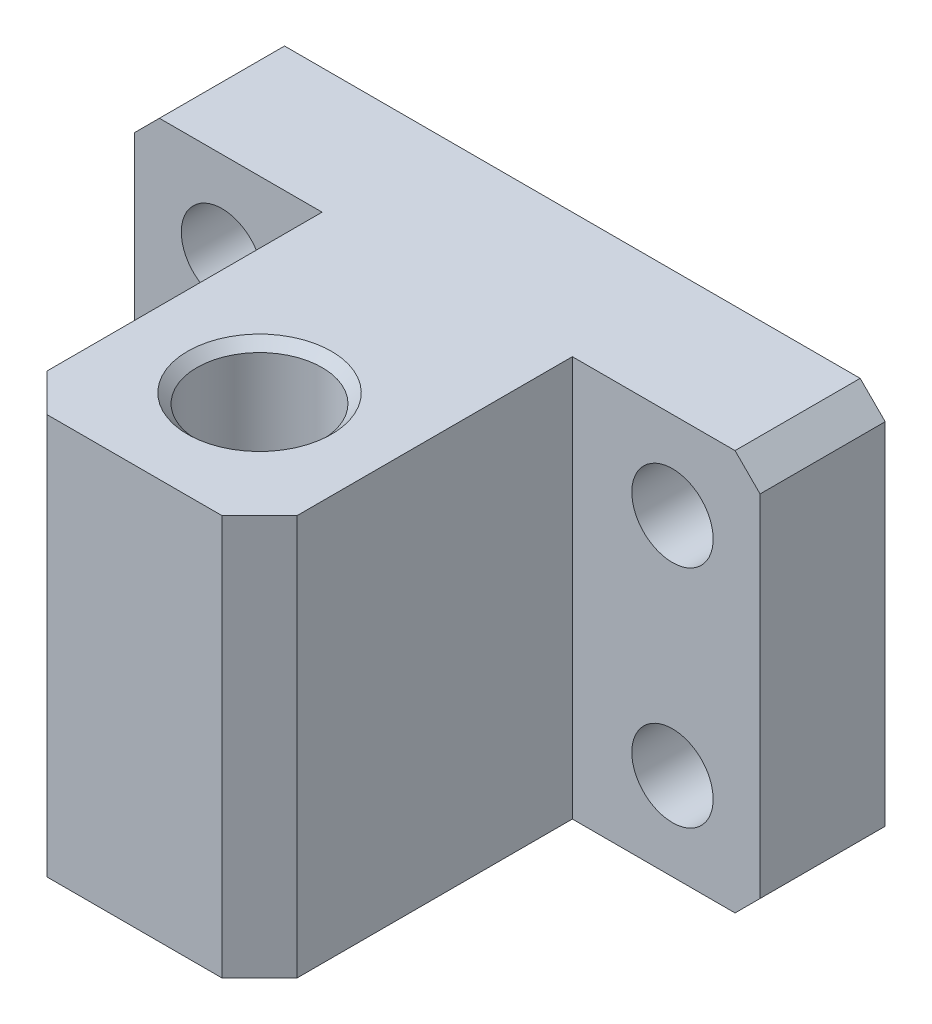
ISO-10303-21;
HEADER;
FILE_DESCRIPTION(('STEP AP214'),'2;1');
FILE_NAME('part.step','',(''),(''),'','','');
FILE_SCHEMA(('AUTOMOTIVE_DESIGN { 1 0 10303 214 1 1 1 1 }'));
ENDSEC;
DATA;
#1=APPLICATION_CONTEXT('core data for automotive mechanical design processes');
#2=APPLICATION_PROTOCOL_DEFINITION('international standard','automotive_design',2000,#1);
#3=PRODUCT_CONTEXT('',#1,'mechanical');
#4=PRODUCT('Part','Part','',(#3));
#5=PRODUCT_RELATED_PRODUCT_CATEGORY('part','',(#4));
#6=PRODUCT_DEFINITION_FORMATION('','',#4);
#7=PRODUCT_DEFINITION_CONTEXT('part definition',#1,'design');
#8=PRODUCT_DEFINITION('design','',#6,#7);
#9=PRODUCT_DEFINITION_SHAPE('','',#8);
#10=(LENGTH_UNIT() NAMED_UNIT(*) SI_UNIT(.MILLI.,.METRE.));
#11=(NAMED_UNIT(*) PLANE_ANGLE_UNIT() SI_UNIT($,.RADIAN.));
#12=(NAMED_UNIT(*) SI_UNIT($,.STERADIAN.) SOLID_ANGLE_UNIT());
#13=UNCERTAINTY_MEASURE_WITH_UNIT(LENGTH_MEASURE(1.E-05),#10,'distance_accuracy_value','');
#14=(GEOMETRIC_REPRESENTATION_CONTEXT(3) GLOBAL_UNCERTAINTY_ASSIGNED_CONTEXT((#13)) GLOBAL_UNIT_ASSIGNED_CONTEXT((#10,
#11,#12)) REPRESENTATION_CONTEXT('',''));
#15=CARTESIAN_POINT('',(0.,0.,0.));
#16=DIRECTION('',(0.,0.,1.));
#17=DIRECTION('',(1.,0.,0.));
#18=AXIS2_PLACEMENT_3D('',#15,#16,#17);
#19=CARTESIAN_POINT('',(-7.,25.,10.));
#20=DIRECTION('',(-1.,0.,0.));
#21=DIRECTION('',(0.,0.,-1.));
#22=AXIS2_PLACEMENT_3D('',#19,#20,#21);
#23=PLANE('',#22);
#24=DIRECTION('',(0.,-1.,0.));
#25=VECTOR('',#24,1.);
#26=CARTESIAN_POINT('',(-7.,25.,0.));
#27=LINE('',#26,#25);
#28=CARTESIAN_POINT('',(-7.,23.,0.));
#29=VERTEX_POINT('',#28);
#30=CARTESIAN_POINT('',(-7.,-5.,0.));
#31=VERTEX_POINT('',#30);
#32=EDGE_CURVE('E152',#29,#31,#27,.T.);
#33=ORIENTED_EDGE('',*,*,#32,.T.);
#34=DIRECTION('',(0.,0.,1.));
#35=VECTOR('',#34,1.);
#36=CARTESIAN_POINT('',(-7.,-5.,10.));
#37=LINE('',#36,#35);
#38=CARTESIAN_POINT('',(-7.,-5.,10.));
#39=VERTEX_POINT('',#38);
#40=EDGE_CURVE('E209',#31,#39,#37,.T.);
#41=ORIENTED_EDGE('',*,*,#40,.T.);
#42=DIRECTION('',(0.,-1.,0.));
#43=VECTOR('',#42,1.);
#44=CARTESIAN_POINT('',(-7.,25.,10.));
#45=LINE('',#44,#43);
#46=CARTESIAN_POINT('',(-7.,23.,10.));
#47=VERTEX_POINT('',#46);
#48=EDGE_CURVE('E168',#47,#39,#45,.T.);
#49=ORIENTED_EDGE('',*,*,#48,.F.);
#50=DIRECTION('',(0.,0.,-1.));
#51=VECTOR('',#50,1.);
#52=CARTESIAN_POINT('',(-7.,23.,10.));
#53=LINE('',#52,#51);
#54=EDGE_CURVE('E206',#47,#29,#53,.T.);
#55=ORIENTED_EDGE('',*,*,#54,.T.);
#56=EDGE_LOOP('',(#33,#41,#49,#55));
#57=FACE_BOUND('',#56,.T.);
#58=ADVANCED_FACE('F14',(#57),#23,.T.);
#59=CARTESIAN_POINT('',(8.,25.,10.));
#60=DIRECTION('',(0.,0.,1.));
#61=DIRECTION('',(-1.,0.,0.));
#62=AXIS2_PLACEMENT_3D('',#59,#60,#61);
#63=PLANE('',#62);
#64=CARTESIAN_POINT('',(0.,18.,10.));
#65=DIRECTION('',(0.,0.,1.));
#66=DIRECTION('',(0.,-1.,0.));
#67=AXIS2_PLACEMENT_3D('',#64,#65,#66);
#68=CIRCLE('',#67,3.25);
#69=CARTESIAN_POINT('',(0.,14.75,10.));
#70=VERTEX_POINT('',#69);
#71=EDGE_CURVE('E335',#70,#70,#68,.T.);
#72=ORIENTED_EDGE('',*,*,#71,.F.);
#73=EDGE_LOOP('',(#72));
#74=FACE_BOUND('',#73,.T.);
#75=CARTESIAN_POINT('',(0.,0.,10.));
#76=DIRECTION('',(0.,0.,1.));
#77=DIRECTION('',(0.,-1.,0.));
#78=AXIS2_PLACEMENT_3D('',#75,#76,#77);
#79=CIRCLE('',#78,3.25);
#80=CARTESIAN_POINT('',(0.,-3.25,10.));
#81=VERTEX_POINT('',#80);
#82=EDGE_CURVE('E317',#81,#81,#79,.T.);
#83=ORIENTED_EDGE('',*,*,#82,.F.);
#84=EDGE_LOOP('',(#83));
#85=FACE_BOUND('',#84,.T.);
#86=ORIENTED_EDGE('',*,*,#48,.T.);
#87=DIRECTION('',(0.707106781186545,-0.707106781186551,0.));
#88=VECTOR('',#87,1.);
#89=CARTESIAN_POINT('',(-14.5,2.50000000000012,10.));
#90=LINE('',#89,#88);
#91=CARTESIAN_POINT('',(-5.,-7.,10.));
#92=VERTEX_POINT('',#91);
#93=EDGE_CURVE('E213',#39,#92,#90,.T.);
#94=ORIENTED_EDGE('',*,*,#93,.T.);
#95=DIRECTION('',(-1.,0.,0.));
#96=VECTOR('',#95,1.);
#97=CARTESIAN_POINT('',(8.,-7.,10.));
#98=LINE('',#97,#96);
#99=CARTESIAN_POINT('',(8.,-7.,10.));
#100=VERTEX_POINT('',#99);
#101=EDGE_CURVE('E165',#100,#92,#98,.T.);
#102=ORIENTED_EDGE('',*,*,#101,.F.);
#103=DIRECTION('',(0.,-1.,0.));
#104=VECTOR('',#103,1.);
#105=CARTESIAN_POINT('',(8.,25.,10.));
#106=LINE('',#105,#104);
#107=CARTESIAN_POINT('',(8.,25.,10.));
#108=VERTEX_POINT('',#107);
#109=EDGE_CURVE('E137',#108,#100,#106,.T.);
#110=ORIENTED_EDGE('',*,*,#109,.F.);
#111=DIRECTION('',(-1.,0.,0.));
#112=VECTOR('',#111,1.);
#113=CARTESIAN_POINT('',(8.,25.,10.));
#114=LINE('',#113,#112);
#115=CARTESIAN_POINT('',(-5.,25.,10.));
#116=VERTEX_POINT('',#115);
#117=EDGE_CURVE('E149',#108,#116,#114,.T.);
#118=ORIENTED_EDGE('',*,*,#117,.T.);
#119=DIRECTION('',(0.707106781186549,0.707106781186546,0.));
#120=VECTOR('',#119,1.);
#121=CARTESIAN_POINT('',(1.50000000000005,31.5,10.));
#122=LINE('',#121,#120);
#123=EDGE_CURVE('E211',#116,#47,#122,.F.);
#124=ORIENTED_EDGE('',*,*,#123,.T.);
#125=EDGE_LOOP('',(#86,#94,#102,#110,#118,#124));
#126=FACE_BOUND('',#125,.T.);
#127=ADVANCED_FACE('F250',(#74,#85,#126),#63,.T.);
#128=CARTESIAN_POINT('',(8.,25.,35.));
#129=DIRECTION('',(-1.,0.,0.));
#130=DIRECTION('',(0.,0.,-1.));
#131=AXIS2_PLACEMENT_3D('',#128,#129,#130);
#132=PLANE('',#131);
#133=DIRECTION('',(0.,0.,-1.));
#134=VECTOR('',#133,1.);
#135=CARTESIAN_POINT('',(8.,-7.,35.));
#136=LINE('',#135,#134);
#137=CARTESIAN_POINT('',(8.,-7.,32.));
#138=VERTEX_POINT('',#137);
#139=EDGE_CURVE('E163',#138,#100,#136,.T.);
#140=ORIENTED_EDGE('',*,*,#139,.F.);
#141=DIRECTION('',(0.,1.,0.));
#142=VECTOR('',#141,1.);
#143=CARTESIAN_POINT('',(8.,25.,32.));
#144=LINE('',#143,#142);
#145=CARTESIAN_POINT('',(8.,25.,32.));
#146=VERTEX_POINT('',#145);
#147=EDGE_CURVE('E38',#138,#146,#144,.T.);
#148=ORIENTED_EDGE('',*,*,#147,.T.);
#149=DIRECTION('',(0.,0.,-1.));
#150=VECTOR('',#149,1.);
#151=CARTESIAN_POINT('',(8.,25.,35.));
#152=LINE('',#151,#150);
#153=EDGE_CURVE('E144',#146,#108,#152,.T.);
#154=ORIENTED_EDGE('',*,*,#153,.T.);
#155=ORIENTED_EDGE('',*,*,#109,.T.);
#156=EDGE_LOOP('',(#140,#148,#154,#155));
#157=FACE_BOUND('',#156,.T.);
#158=ADVANCED_FACE('F256',(#157),#132,.T.);
#159=CARTESIAN_POINT('',(28.,25.,35.));
#160=DIRECTION('',(0.,0.,1.));
#161=DIRECTION('',(0.,-1.,0.));
#162=AXIS2_PLACEMENT_3D('',#159,#160,#161);
#163=PLANE('',#162);
#164=DIRECTION('',(-1.,0.,0.));
#165=VECTOR('',#164,1.);
#166=CARTESIAN_POINT('',(28.,25.,35.));
#167=LINE('',#166,#165);
#168=CARTESIAN_POINT('',(25.,25.,35.));
#169=VERTEX_POINT('',#168);
#170=CARTESIAN_POINT('',(11.,25.,35.));
#171=VERTEX_POINT('',#170);
#172=EDGE_CURVE('E141',#169,#171,#167,.T.);
#173=ORIENTED_EDGE('',*,*,#172,.T.);
#174=DIRECTION('',(0.,-1.,0.));
#175=VECTOR('',#174,1.);
#176=CARTESIAN_POINT('',(11.,25.,35.));
#177=LINE('',#176,#175);
#178=CARTESIAN_POINT('',(11.,-7.,35.));
#179=VERTEX_POINT('',#178);
#180=EDGE_CURVE('E217',#171,#179,#177,.T.);
#181=ORIENTED_EDGE('',*,*,#180,.T.);
#182=DIRECTION('',(-1.,0.,0.));
#183=VECTOR('',#182,1.);
#184=CARTESIAN_POINT('',(28.,-7.,35.));
#185=LINE('',#184,#183);
#186=CARTESIAN_POINT('',(25.,-7.,35.));
#187=VERTEX_POINT('',#186);
#188=EDGE_CURVE('E160',#187,#179,#185,.T.);
#189=ORIENTED_EDGE('',*,*,#188,.F.);
#190=DIRECTION('',(0.,1.,0.));
#191=VECTOR('',#190,1.);
#192=CARTESIAN_POINT('',(25.,25.,35.));
#193=LINE('',#192,#191);
#194=EDGE_CURVE('E215',#187,#169,#193,.T.);
#195=ORIENTED_EDGE('',*,*,#194,.T.);
#196=EDGE_LOOP('',(#173,#181,#189,#195));
#197=FACE_BOUND('',#196,.T.);
#198=ADVANCED_FACE('F288',(#197),#163,.T.);
#199=CARTESIAN_POINT('',(28.,25.,10.));
#200=DIRECTION('',(1.,0.,0.));
#201=DIRECTION('',(0.,0.,1.));
#202=AXIS2_PLACEMENT_3D('',#199,#200,#201);
#203=PLANE('',#202);
#204=DIRECTION('',(0.,0.,1.));
#205=VECTOR('',#204,1.);
#206=CARTESIAN_POINT('',(28.,25.,10.));
#207=LINE('',#206,#205);
#208=CARTESIAN_POINT('',(28.,25.,10.));
#209=VERTEX_POINT('',#208);
#210=CARTESIAN_POINT('',(28.,25.,32.));
#211=VERTEX_POINT('',#210);
#212=EDGE_CURVE('E128',#209,#211,#207,.T.);
#213=ORIENTED_EDGE('',*,*,#212,.T.);
#214=DIRECTION('',(0.,-1.,0.));
#215=VECTOR('',#214,1.);
#216=CARTESIAN_POINT('',(28.,25.,32.));
#217=LINE('',#216,#215);
#218=CARTESIAN_POINT('',(28.,-7.,32.));
#219=VERTEX_POINT('',#218);
#220=EDGE_CURVE('E228',#211,#219,#217,.T.);
#221=ORIENTED_EDGE('',*,*,#220,.T.);
#222=DIRECTION('',(0.,0.,1.));
#223=VECTOR('',#222,1.);
#224=CARTESIAN_POINT('',(28.,-7.,10.));
#225=LINE('',#224,#223);
#226=CARTESIAN_POINT('',(28.,-7.,10.));
#227=VERTEX_POINT('',#226);
#228=EDGE_CURVE('E136',#227,#219,#225,.T.);
#229=ORIENTED_EDGE('',*,*,#228,.F.);
#230=DIRECTION('',(0.,-1.,0.));
#231=VECTOR('',#230,1.);
#232=CARTESIAN_POINT('',(28.,25.,10.));
#233=LINE('',#232,#231);
#234=EDGE_CURVE('E123',#209,#227,#233,.T.);
#235=ORIENTED_EDGE('',*,*,#234,.F.);
#236=EDGE_LOOP('',(#213,#221,#229,#235));
#237=FACE_BOUND('',#236,.T.);
#238=ADVANCED_FACE('F132',(#237),#203,.T.);
#239=CARTESIAN_POINT('',(43.,25.,10.));
#240=DIRECTION('',(0.,0.,1.));
#241=DIRECTION('',(-1.,0.,0.));
#242=AXIS2_PLACEMENT_3D('',#239,#240,#241);
#243=PLANE('',#242);
#244=CARTESIAN_POINT('',(36.,18.,10.));
#245=DIRECTION('',(0.,0.,1.));
#246=DIRECTION('',(0.,-1.,0.));
#247=AXIS2_PLACEMENT_3D('',#244,#245,#246);
#248=CIRCLE('',#247,3.25);
#249=CARTESIAN_POINT('',(36.,14.75,10.));
#250=VERTEX_POINT('',#249);
#251=EDGE_CURVE('E329',#250,#250,#248,.T.);
#252=ORIENTED_EDGE('',*,*,#251,.F.);
#253=EDGE_LOOP('',(#252));
#254=FACE_BOUND('',#253,.T.);
#255=CARTESIAN_POINT('',(36.,0.,10.));
#256=DIRECTION('',(0.,0.,1.));
#257=DIRECTION('',(0.,-1.,0.));
#258=AXIS2_PLACEMENT_3D('',#255,#256,#257);
#259=CIRCLE('',#258,3.25);
#260=CARTESIAN_POINT('',(36.,-3.25,10.));
#261=VERTEX_POINT('',#260);
#262=EDGE_CURVE('E323',#261,#261,#259,.T.);
#263=ORIENTED_EDGE('',*,*,#262,.F.);
#264=EDGE_LOOP('',(#263));
#265=FACE_BOUND('',#264,.T.);
#266=DIRECTION('',(-1.,0.,0.));
#267=VECTOR('',#266,1.);
#268=CARTESIAN_POINT('',(43.,-7.,10.));
#269=LINE('',#268,#267);
#270=CARTESIAN_POINT('',(41.,-7.,10.));
#271=VERTEX_POINT('',#270);
#272=EDGE_CURVE('E156',#271,#227,#269,.T.);
#273=ORIENTED_EDGE('',*,*,#272,.F.);
#274=DIRECTION('',(0.707106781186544,0.707106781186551,0.));
#275=VECTOR('',#274,1.);
#276=CARTESIAN_POINT('',(58.,10.0000000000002,10.));
#277=LINE('',#276,#275);
#278=CARTESIAN_POINT('',(43.,-5.,10.));
#279=VERTEX_POINT('',#278);
#280=EDGE_CURVE('E187',#271,#279,#277,.T.);
#281=ORIENTED_EDGE('',*,*,#280,.T.);
#282=DIRECTION('',(0.,-1.,0.));
#283=VECTOR('',#282,1.);
#284=CARTESIAN_POINT('',(43.,25.,10.));
#285=LINE('',#284,#283);
#286=CARTESIAN_POINT('',(43.,23.,10.));
#287=VERTEX_POINT('',#286);
#288=EDGE_CURVE('E138',#287,#279,#285,.T.);
#289=ORIENTED_EDGE('',*,*,#288,.F.);
#290=DIRECTION('',(0.70710678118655,-0.707106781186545,0.));
#291=VECTOR('',#290,1.);
#292=CARTESIAN_POINT('',(42.,24.,10.));
#293=LINE('',#292,#291);
#294=CARTESIAN_POINT('',(41.,25.,10.));
#295=VERTEX_POINT('',#294);
#296=EDGE_CURVE('E126',#287,#295,#293,.F.);
#297=ORIENTED_EDGE('',*,*,#296,.T.);
#298=DIRECTION('',(-1.,0.,0.));
#299=VECTOR('',#298,1.);
#300=CARTESIAN_POINT('',(43.,25.,10.));
#301=LINE('',#300,#299);
#302=EDGE_CURVE('E119',#295,#209,#301,.T.);
#303=ORIENTED_EDGE('',*,*,#302,.T.);
#304=ORIENTED_EDGE('',*,*,#234,.T.);
#305=EDGE_LOOP('',(#273,#281,#289,#297,#303,#304));
#306=FACE_BOUND('',#305,.T.);
#307=ADVANCED_FACE('F122',(#254,#265,#306),#243,.T.);
#308=CARTESIAN_POINT('',(43.,25.,0.));
#309=DIRECTION('',(1.,0.,0.));
#310=DIRECTION('',(0.,0.,1.));
#311=AXIS2_PLACEMENT_3D('',#308,#309,#310);
#312=PLANE('',#311);
#313=ORIENTED_EDGE('',*,*,#288,.T.);
#314=DIRECTION('',(0.,0.,-1.));
#315=VECTOR('',#314,1.);
#316=CARTESIAN_POINT('',(43.,-5.,0.));
#317=LINE('',#316,#315);
#318=CARTESIAN_POINT('',(43.,-5.,0.));
#319=VERTEX_POINT('',#318);
#320=EDGE_CURVE('E192',#279,#319,#317,.T.);
#321=ORIENTED_EDGE('',*,*,#320,.T.);
#322=DIRECTION('',(0.,-1.,0.));
#323=VECTOR('',#322,1.);
#324=CARTESIAN_POINT('',(43.,25.,0.));
#325=LINE('',#324,#323);
#326=CARTESIAN_POINT('',(43.,23.,0.));
#327=VERTEX_POINT('',#326);
#328=EDGE_CURVE('E176',#327,#319,#325,.T.);
#329=ORIENTED_EDGE('',*,*,#328,.F.);
#330=DIRECTION('',(0.,0.,1.));
#331=VECTOR('',#330,1.);
#332=CARTESIAN_POINT('',(43.,23.,0.));
#333=LINE('',#332,#331);
#334=EDGE_CURVE('E189',#327,#287,#333,.T.);
#335=ORIENTED_EDGE('',*,*,#334,.T.);
#336=EDGE_LOOP('',(#313,#321,#329,#335));
#337=FACE_BOUND('',#336,.T.);
#338=ADVANCED_FACE('F296',(#337),#312,.T.);
#339=CARTESIAN_POINT('',(-7.,25.,0.));
#340=DIRECTION('',(0.,0.,-1.));
#341=DIRECTION('',(0.,1.,0.));
#342=AXIS2_PLACEMENT_3D('',#339,#340,#341);
#343=PLANE('',#342);
#344=CARTESIAN_POINT('',(0.,18.,0.));
#345=DIRECTION('',(0.,0.,-1.));
#346=DIRECTION('',(0.,1.,0.));
#347=AXIS2_PLACEMENT_3D('',#344,#345,#346);
#348=CIRCLE('',#347,3.25);
#349=CARTESIAN_POINT('',(0.,21.25,0.));
#350=VERTEX_POINT('',#349);
#351=EDGE_CURVE('E332',#350,#350,#348,.T.);
#352=ORIENTED_EDGE('',*,*,#351,.F.);
#353=EDGE_LOOP('',(#352));
#354=FACE_BOUND('',#353,.T.);
#355=CARTESIAN_POINT('',(36.,18.,0.));
#356=DIRECTION('',(0.,0.,-1.));
#357=DIRECTION('',(0.,1.,0.));
#358=AXIS2_PLACEMENT_3D('',#355,#356,#357);
#359=CIRCLE('',#358,3.25);
#360=CARTESIAN_POINT('',(36.,21.25,0.));
#361=VERTEX_POINT('',#360);
#362=EDGE_CURVE('E326',#361,#361,#359,.T.);
#363=ORIENTED_EDGE('',*,*,#362,.F.);
#364=EDGE_LOOP('',(#363));
#365=FACE_BOUND('',#364,.T.);
#366=CARTESIAN_POINT('',(36.,0.,0.));
#367=DIRECTION('',(0.,0.,-1.));
#368=DIRECTION('',(0.,1.,0.));
#369=AXIS2_PLACEMENT_3D('',#366,#367,#368);
#370=CIRCLE('',#369,3.25);
#371=CARTESIAN_POINT('',(36.,3.25,0.));
#372=VERTEX_POINT('',#371);
#373=EDGE_CURVE('E320',#372,#372,#370,.T.);
#374=ORIENTED_EDGE('',*,*,#373,.F.);
#375=EDGE_LOOP('',(#374));
#376=FACE_BOUND('',#375,.T.);
#377=CARTESIAN_POINT('',(0.,0.,0.));
#378=DIRECTION('',(0.,0.,-1.));
#379=DIRECTION('',(0.,1.,0.));
#380=AXIS2_PLACEMENT_3D('',#377,#378,#379);
#381=CIRCLE('',#380,3.25);
#382=CARTESIAN_POINT('',(0.,3.25,0.));
#383=VERTEX_POINT('',#382);
#384=EDGE_CURVE('E157',#383,#383,#381,.T.);
#385=ORIENTED_EDGE('',*,*,#384,.F.);
#386=EDGE_LOOP('',(#385));
#387=FACE_BOUND('',#386,.T.);
#388=ORIENTED_EDGE('',*,*,#328,.T.);
#389=DIRECTION('',(-0.707106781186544,-0.707106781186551,0.));
#390=VECTOR('',#389,1.);
#391=CARTESIAN_POINT('',(33.,-14.9999999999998,0.));
#392=LINE('',#391,#390);
#393=CARTESIAN_POINT('',(41.,-7.,0.));
#394=VERTEX_POINT('',#393);
#395=EDGE_CURVE('E200',#319,#394,#392,.T.);
#396=ORIENTED_EDGE('',*,*,#395,.T.);
#397=DIRECTION('',(1.,0.,0.));
#398=VECTOR('',#397,1.);
#399=CARTESIAN_POINT('',(-7.,-7.,0.));
#400=LINE('',#399,#398);
#401=CARTESIAN_POINT('',(-5.,-7.,0.));
#402=VERTEX_POINT('',#401);
#403=EDGE_CURVE('E153',#402,#394,#400,.T.);
#404=ORIENTED_EDGE('',*,*,#403,.F.);
#405=DIRECTION('',(-0.707106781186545,0.707106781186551,0.));
#406=VECTOR('',#405,1.);
#407=CARTESIAN_POINT('',(-22.,10.0000000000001,0.));
#408=LINE('',#407,#406);
#409=EDGE_CURVE('E196',#402,#31,#408,.T.);
#410=ORIENTED_EDGE('',*,*,#409,.T.);
#411=ORIENTED_EDGE('',*,*,#32,.F.);
#412=DIRECTION('',(-0.707106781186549,-0.707106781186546,0.));
#413=VECTOR('',#412,1.);
#414=CARTESIAN_POINT('',(-6.,24.,0.));
#415=LINE('',#414,#413);
#416=CARTESIAN_POINT('',(-5.,25.,0.));
#417=VERTEX_POINT('',#416);
#418=EDGE_CURVE('E194',#29,#417,#415,.F.);
#419=ORIENTED_EDGE('',*,*,#418,.T.);
#420=DIRECTION('',(1.,0.,0.));
#421=VECTOR('',#420,1.);
#422=CARTESIAN_POINT('',(-7.,25.,0.));
#423=LINE('',#422,#421);
#424=CARTESIAN_POINT('',(41.,25.,0.));
#425=VERTEX_POINT('',#424);
#426=EDGE_CURVE('E129',#417,#425,#423,.T.);
#427=ORIENTED_EDGE('',*,*,#426,.T.);
#428=DIRECTION('',(-0.70710678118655,0.707106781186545,0.));
#429=VECTOR('',#428,1.);
#430=CARTESIAN_POINT('',(17.,49.,0.));
#431=LINE('',#430,#429);
#432=EDGE_CURVE('E198',#425,#327,#431,.F.);
#433=ORIENTED_EDGE('',*,*,#432,.T.);
#434=EDGE_LOOP('',(#388,#396,#404,#410,#411,#419,#427,#433));
#435=FACE_BOUND('',#434,.T.);
#436=ADVANCED_FACE('F261',(#354,#365,#376,#387,#435),#343,.T.);
#437=CARTESIAN_POINT('',(-7.,25.,10.));
#438=DIRECTION('',(0.,1.,0.));
#439=DIRECTION('',(-1.,0.,0.));
#440=AXIS2_PLACEMENT_3D('',#437,#438,#439);
#441=PLANE('',#440);
#442=CARTESIAN_POINT('',(18.,25.,25.));
#443=DIRECTION('',(0.,1.,0.));
#444=DIRECTION('',(-1.,0.,0.));
#445=AXIS2_PLACEMENT_3D('',#442,#443,#444);
#446=CIRCLE('',#445,5.75);
#447=CARTESIAN_POINT('',(12.25,25.,25.));
#448=VERTEX_POINT('',#447);
#449=EDGE_CURVE('E23',#448,#448,#446,.F.);
#450=ORIENTED_EDGE('',*,*,#449,.T.);
#451=EDGE_LOOP('',(#450));
#452=FACE_BOUND('',#451,.T.);
#453=ORIENTED_EDGE('',*,*,#153,.F.);
#454=DIRECTION('',(-0.707106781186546,0.,-0.707106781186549));
#455=VECTOR('',#454,1.);
#456=CARTESIAN_POINT('',(-10.5,25.,13.5));
#457=LINE('',#456,#455);
#458=EDGE_CURVE('E226',#146,#171,#457,.F.);
#459=ORIENTED_EDGE('',*,*,#458,.T.);
#460=ORIENTED_EDGE('',*,*,#172,.F.);
#461=DIRECTION('',(-0.70710678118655,0.,0.707106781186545));
#462=VECTOR('',#461,1.);
#463=CARTESIAN_POINT('',(21.5,25.,38.5));
#464=LINE('',#463,#462);
#465=EDGE_CURVE('E30',#169,#211,#464,.F.);
#466=ORIENTED_EDGE('',*,*,#465,.T.);
#467=ORIENTED_EDGE('',*,*,#212,.F.);
#468=ORIENTED_EDGE('',*,*,#302,.F.);
#469=DIRECTION('',(0.,0.,-1.));
#470=VECTOR('',#469,1.);
#471=CARTESIAN_POINT('',(41.,25.,10.));
#472=LINE('',#471,#470);
#473=EDGE_CURVE('E204',#295,#425,#472,.T.);
#474=ORIENTED_EDGE('',*,*,#473,.T.);
#475=ORIENTED_EDGE('',*,*,#426,.F.);
#476=DIRECTION('',(0.,0.,1.));
#477=VECTOR('',#476,1.);
#478=CARTESIAN_POINT('',(-5.,25.,10.));
#479=LINE('',#478,#477);
#480=EDGE_CURVE('E202',#417,#116,#479,.T.);
#481=ORIENTED_EDGE('',*,*,#480,.T.);
#482=ORIENTED_EDGE('',*,*,#117,.F.);
#483=EDGE_LOOP('',(#453,#459,#460,#466,#467,#468,#474,#475,#481,#482));
#484=FACE_BOUND('',#483,.T.);
#485=ADVANCED_FACE('F140',(#452,#484),#441,.T.);
#486=CARTESIAN_POINT('',(-7.,-7.,10.));
#487=DIRECTION('',(0.,1.,0.));
#488=DIRECTION('',(-1.,0.,0.));
#489=AXIS2_PLACEMENT_3D('',#486,#487,#488);
#490=PLANE('',#489);
#491=CARTESIAN_POINT('',(18.,-7.,25.));
#492=DIRECTION('',(0.,1.,0.));
#493=DIRECTION('',(-1.,0.,0.));
#494=AXIS2_PLACEMENT_3D('',#491,#492,#493);
#495=CIRCLE('',#494,5.75);
#496=CARTESIAN_POINT('',(12.25,-7.,25.));
#497=VERTEX_POINT('',#496);
#498=EDGE_CURVE('E9',#497,#497,#495,.T.);
#499=ORIENTED_EDGE('',*,*,#498,.T.);
#500=EDGE_LOOP('',(#499));
#501=FACE_BOUND('',#500,.T.);
#502=ORIENTED_EDGE('',*,*,#188,.T.);
#503=DIRECTION('',(0.707106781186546,0.,0.707106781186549));
#504=VECTOR('',#503,1.);
#505=CARTESIAN_POINT('',(11.,-7.,35.));
#506=LINE('',#505,#504);
#507=EDGE_CURVE('E222',#179,#138,#506,.F.);
#508=ORIENTED_EDGE('',*,*,#507,.T.);
#509=ORIENTED_EDGE('',*,*,#139,.T.);
#510=ORIENTED_EDGE('',*,*,#101,.T.);
#511=DIRECTION('',(0.,0.,-1.));
#512=VECTOR('',#511,1.);
#513=CARTESIAN_POINT('',(-5.,-7.,0.));
#514=LINE('',#513,#512);
#515=EDGE_CURVE('E171',#92,#402,#514,.T.);
#516=ORIENTED_EDGE('',*,*,#515,.T.);
#517=ORIENTED_EDGE('',*,*,#403,.T.);
#518=DIRECTION('',(0.,0.,1.));
#519=VECTOR('',#518,1.);
#520=CARTESIAN_POINT('',(41.,-7.,10.));
#521=LINE('',#520,#519);
#522=EDGE_CURVE('E183',#394,#271,#521,.T.);
#523=ORIENTED_EDGE('',*,*,#522,.T.);
#524=ORIENTED_EDGE('',*,*,#272,.T.);
#525=ORIENTED_EDGE('',*,*,#228,.T.);
#526=DIRECTION('',(0.70710678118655,0.,-0.707106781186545));
#527=VECTOR('',#526,1.);
#528=CARTESIAN_POINT('',(28.,-7.,32.));
#529=LINE('',#528,#527);
#530=EDGE_CURVE('E220',#219,#187,#529,.F.);
#531=ORIENTED_EDGE('',*,*,#530,.T.);
#532=EDGE_LOOP('',(#502,#508,#509,#510,#516,#517,#523,#524,#525,#531));
#533=FACE_BOUND('',#532,.T.);
#534=ADVANCED_FACE('F292',(#501,#533),#490,.F.);
#535=CARTESIAN_POINT('',(0.,0.,10.));
#536=DIRECTION('',(0.,0.,1.));
#537=DIRECTION('',(0.,-1.,0.));
#538=AXIS2_PLACEMENT_3D('',#535,#536,#537);
#539=CYLINDRICAL_SURFACE('',#538,3.25);
#540=ORIENTED_EDGE('',*,*,#82,.T.);
#541=EDGE_LOOP('',(#540));
#542=FACE_BOUND('',#541,.T.);
#543=ORIENTED_EDGE('',*,*,#384,.T.);
#544=EDGE_LOOP('',(#543));
#545=FACE_BOUND('',#544,.T.);
#546=ADVANCED_FACE('F348',(#542,#545),#539,.F.);
#547=CARTESIAN_POINT('',(36.,0.,10.));
#548=DIRECTION('',(0.,0.,1.));
#549=DIRECTION('',(0.,-1.,0.));
#550=AXIS2_PLACEMENT_3D('',#547,#548,#549);
#551=CYLINDRICAL_SURFACE('',#550,3.25);
#552=ORIENTED_EDGE('',*,*,#262,.T.);
#553=EDGE_LOOP('',(#552));
#554=FACE_BOUND('',#553,.T.);
#555=ORIENTED_EDGE('',*,*,#373,.T.);
#556=EDGE_LOOP('',(#555));
#557=FACE_BOUND('',#556,.T.);
#558=ADVANCED_FACE('F354',(#554,#557),#551,.F.);
#559=CARTESIAN_POINT('',(36.,18.,10.));
#560=DIRECTION('',(0.,0.,1.));
#561=DIRECTION('',(0.,-1.,0.));
#562=AXIS2_PLACEMENT_3D('',#559,#560,#561);
#563=CYLINDRICAL_SURFACE('',#562,3.25);
#564=ORIENTED_EDGE('',*,*,#251,.T.);
#565=EDGE_LOOP('',(#564));
#566=FACE_BOUND('',#565,.T.);
#567=ORIENTED_EDGE('',*,*,#362,.T.);
#568=EDGE_LOOP('',(#567));
#569=FACE_BOUND('',#568,.T.);
#570=ADVANCED_FACE('F384',(#566,#569),#563,.F.);
#571=CARTESIAN_POINT('',(0.,18.,10.));
#572=DIRECTION('',(0.,0.,1.));
#573=DIRECTION('',(0.,-1.,0.));
#574=AXIS2_PLACEMENT_3D('',#571,#572,#573);
#575=CYLINDRICAL_SURFACE('',#574,3.25);
#576=ORIENTED_EDGE('',*,*,#71,.T.);
#577=EDGE_LOOP('',(#576));
#578=FACE_BOUND('',#577,.T.);
#579=ORIENTED_EDGE('',*,*,#351,.T.);
#580=EDGE_LOOP('',(#579));
#581=FACE_BOUND('',#580,.T.);
#582=ADVANCED_FACE('F267',(#578,#581),#575,.F.);
#583=CARTESIAN_POINT('',(41.,-7.,10.));
#584=DIRECTION('',(0.707106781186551,-0.707106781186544,0.));
#585=DIRECTION('',(0.707106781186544,0.707106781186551,0.));
#586=AXIS2_PLACEMENT_3D('',#583,#584,#585);
#587=PLANE('',#586);
#588=ORIENTED_EDGE('',*,*,#395,.F.);
#589=ORIENTED_EDGE('',*,*,#320,.F.);
#590=ORIENTED_EDGE('',*,*,#280,.F.);
#591=ORIENTED_EDGE('',*,*,#522,.F.);
#592=EDGE_LOOP('',(#588,#589,#590,#591));
#593=FACE_BOUND('',#592,.T.);
#594=ADVANCED_FACE('F263',(#593),#587,.T.);
#595=CARTESIAN_POINT('',(43.,23.,0.));
#596=DIRECTION('',(-0.707106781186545,-0.70710678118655,0.));
#597=DIRECTION('',(0.70710678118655,-0.707106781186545,0.));
#598=AXIS2_PLACEMENT_3D('',#595,#596,#597);
#599=PLANE('',#598);
#600=ORIENTED_EDGE('',*,*,#432,.F.);
#601=ORIENTED_EDGE('',*,*,#473,.F.);
#602=ORIENTED_EDGE('',*,*,#296,.F.);
#603=ORIENTED_EDGE('',*,*,#334,.F.);
#604=EDGE_LOOP('',(#600,#601,#602,#603));
#605=FACE_BOUND('',#604,.T.);
#606=ADVANCED_FACE('F266',(#605),#599,.F.);
#607=CARTESIAN_POINT('',(-5.,-7.,10.));
#608=DIRECTION('',(-0.707106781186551,-0.707106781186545,0.));
#609=DIRECTION('',(0.707106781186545,-0.707106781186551,0.));
#610=AXIS2_PLACEMENT_3D('',#607,#608,#609);
#611=PLANE('',#610);
#612=ORIENTED_EDGE('',*,*,#93,.F.);
#613=ORIENTED_EDGE('',*,*,#40,.F.);
#614=ORIENTED_EDGE('',*,*,#409,.F.);
#615=ORIENTED_EDGE('',*,*,#515,.F.);
#616=EDGE_LOOP('',(#612,#613,#614,#615));
#617=FACE_BOUND('',#616,.T.);
#618=ADVANCED_FACE('F271',(#617),#611,.T.);
#619=CARTESIAN_POINT('',(-7.,23.,10.));
#620=DIRECTION('',(0.707106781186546,-0.707106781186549,0.));
#621=DIRECTION('',(0.707106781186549,0.707106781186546,0.));
#622=AXIS2_PLACEMENT_3D('',#619,#620,#621);
#623=PLANE('',#622);
#624=ORIENTED_EDGE('',*,*,#123,.F.);
#625=ORIENTED_EDGE('',*,*,#480,.F.);
#626=ORIENTED_EDGE('',*,*,#418,.F.);
#627=ORIENTED_EDGE('',*,*,#54,.F.);
#628=EDGE_LOOP('',(#624,#625,#626,#627));
#629=FACE_BOUND('',#628,.T.);
#630=ADVANCED_FACE('F275',(#629),#623,.F.);
#631=CARTESIAN_POINT('',(11.,25.,35.));
#632=DIRECTION('',(0.707106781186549,0.,-0.707106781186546));
#633=DIRECTION('',(0.707106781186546,0.,0.707106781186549));
#634=AXIS2_PLACEMENT_3D('',#631,#632,#633);
#635=PLANE('',#634);
#636=ORIENTED_EDGE('',*,*,#458,.F.);
#637=ORIENTED_EDGE('',*,*,#147,.F.);
#638=ORIENTED_EDGE('',*,*,#507,.F.);
#639=ORIENTED_EDGE('',*,*,#180,.F.);
#640=EDGE_LOOP('',(#636,#637,#638,#639));
#641=FACE_BOUND('',#640,.T.);
#642=ADVANCED_FACE('F245',(#641),#635,.F.);
#643=CARTESIAN_POINT('',(28.,25.,32.));
#644=DIRECTION('',(-0.707106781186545,0.,-0.70710678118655));
#645=DIRECTION('',(0.70710678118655,0.,-0.707106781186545));
#646=AXIS2_PLACEMENT_3D('',#643,#644,#645);
#647=PLANE('',#646);
#648=ORIENTED_EDGE('',*,*,#465,.F.);
#649=ORIENTED_EDGE('',*,*,#194,.F.);
#650=ORIENTED_EDGE('',*,*,#530,.F.);
#651=ORIENTED_EDGE('',*,*,#220,.F.);
#652=EDGE_LOOP('',(#648,#649,#650,#651));
#653=FACE_BOUND('',#652,.T.);
#654=ADVANCED_FACE('F236',(#653),#647,.F.);
#655=CARTESIAN_POINT('',(18.,23.5,25.));
#656=DIRECTION('',(0.,1.,0.));
#657=DIRECTION('',(-1.,0.,0.));
#658=AXIS2_PLACEMENT_3D('',#655,#656,#657);
#659=CONICAL_SURFACE('',#658,4.25,0.785398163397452);
#660=CARTESIAN_POINT('',(18.,24.25,25.));
#661=DIRECTION('',(0.,1.,0.));
#662=DIRECTION('',(0.,0.,1.));
#663=AXIS2_PLACEMENT_3D('',#660,#661,#662);
#664=CIRCLE('',#663,5.);
#665=CARTESIAN_POINT('',(18.,24.25,30.));
#666=VERTEX_POINT('',#665);
#667=EDGE_CURVE('E338',#666,#666,#664,.T.);
#668=ORIENTED_EDGE('',*,*,#667,.F.);
#669=EDGE_LOOP('',(#668));
#670=FACE_BOUND('',#669,.T.);
#671=ORIENTED_EDGE('',*,*,#449,.F.);
#672=EDGE_LOOP('',(#671));
#673=FACE_BOUND('',#672,.T.);
#674=ADVANCED_FACE('F234',(#670,#673),#659,.F.);
#675=CARTESIAN_POINT('',(18.,-7.,25.));
#676=DIRECTION('',(0.,-1.,0.));
#677=DIRECTION('',(1.,0.,0.));
#678=AXIS2_PLACEMENT_3D('',#675,#676,#677);
#679=CONICAL_SURFACE('',#678,5.75,0.785398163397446);
#680=CARTESIAN_POINT('',(18.,-6.25,25.));
#681=DIRECTION('',(0.,-1.,0.));
#682=DIRECTION('',(0.,0.,-1.));
#683=AXIS2_PLACEMENT_3D('',#680,#681,#682);
#684=CIRCLE('',#683,5.);
#685=CARTESIAN_POINT('',(18.,-6.25,20.));
#686=VERTEX_POINT('',#685);
#687=EDGE_CURVE('E18',#686,#686,#684,.T.);
#688=ORIENTED_EDGE('',*,*,#687,.F.);
#689=EDGE_LOOP('',(#688));
#690=FACE_BOUND('',#689,.T.);
#691=ORIENTED_EDGE('',*,*,#498,.F.);
#692=EDGE_LOOP('',(#691));
#693=FACE_BOUND('',#692,.T.);
#694=ADVANCED_FACE('F16',(#690,#693),#679,.F.);
#695=CARTESIAN_POINT('',(18.,-7.,25.));
#696=DIRECTION('',(0.,1.,0.));
#697=DIRECTION('',(0.,0.,1.));
#698=AXIS2_PLACEMENT_3D('',#695,#696,#697);
#699=CYLINDRICAL_SURFACE('',#698,5.);
#700=ORIENTED_EDGE('',*,*,#667,.T.);
#701=EDGE_LOOP('',(#700));
#702=FACE_BOUND('',#701,.T.);
#703=ORIENTED_EDGE('',*,*,#687,.T.);
#704=EDGE_LOOP('',(#703));
#705=FACE_BOUND('',#704,.T.);
#706=ADVANCED_FACE('F243',(#702,#705),#699,.F.);
#707=CLOSED_SHELL('',(#58,#127,#158,#198,#238,#307,#338,#436,#485,#534,#546,#558,#570,#582,#594,
#606,#618,#630,#642,#654,#674,#694,#706));
#708=MANIFOLD_SOLID_BREP('B1',#707);
#709=ADVANCED_BREP_SHAPE_REPRESENTATION('',(#18,#708),#14);
#710=SHAPE_DEFINITION_REPRESENTATION(#9,#709);
ENDSEC;
END-ISO-10303-21;
